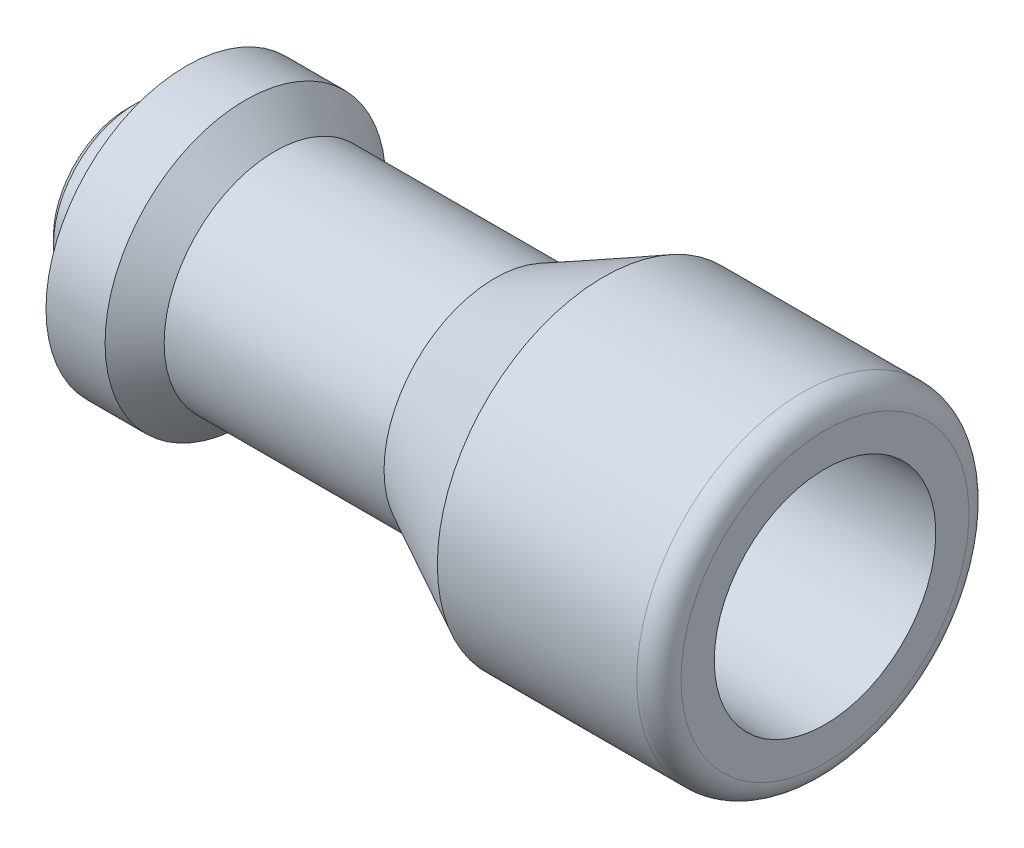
from build123d import *


with BuildPart() as part:
    # Sketch1 → Revolve1 (revolve)
    with BuildSketch(Plane.XY, mode=Mode.PRIVATE) as revolve1_sk:
        with BuildLine():
            Line((44.5, 5.1), (41.555513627, 0))
            Line((41.555513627, 0), (0, 0))
            Line((0, 0), (0, 10))
            Line((0, 10), (1, 11))
            Line((1, 11), (8, 11))
            Line((8, 11), (8, 19))
            Line((8, 19), (16, 19))
            Line((16, 19), (20, 15))
            Line((20, 15), (49.780421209, 15))
            Line((49.780421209, 15), (64.5, 22.5))
            Line((64.5, 22.5), (91.5, 22.5))
            ThreePointArc((91.5, 22.5), (93.621320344, 21.621320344), (94.5, 19.5))
            Line((94.5, 19.5), (94.5, 15))
            Line((94.5, 15), (67.272080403, 14.049180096))
            ThreePointArc((67.272080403, 14.049180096), (66.72452816, 13.805394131), (66.5, 13.249667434))
            Line((66.5, 13.249667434), (66.5, 5.1))
            Line((66.5, 5.1), (44.5, 5.1))
        make_face()
    revolve(revolve1_sk.sketch.rotate(Axis((0, 0, 0), (1, 0, 0)), 90), axis=Axis((0, 0, 0), (1, 0, 0)))


solid = part.part
